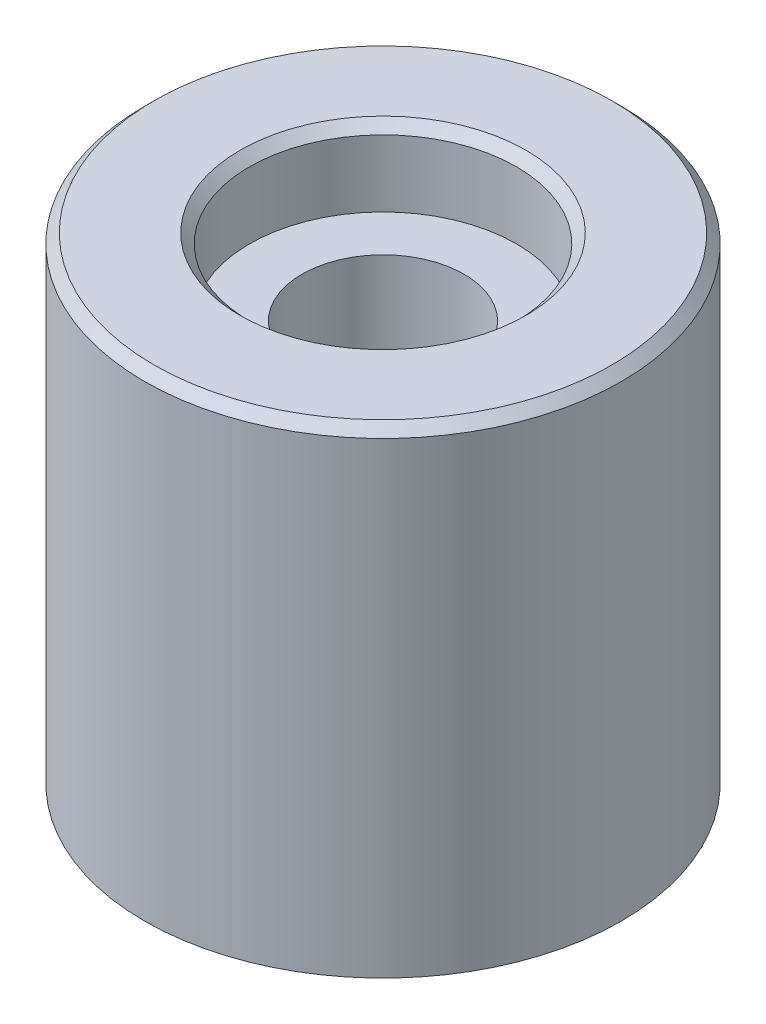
ISO-10303-21;
HEADER;
FILE_DESCRIPTION(('STEP AP214'),'2;1');
FILE_NAME('part.step','',(''),(''),'','','');
FILE_SCHEMA(('AUTOMOTIVE_DESIGN { 1 0 10303 214 1 1 1 1 }'));
ENDSEC;
DATA;
#1=APPLICATION_CONTEXT('core data for automotive mechanical design processes');
#2=APPLICATION_PROTOCOL_DEFINITION('international standard','automotive_design',2000,#1);
#3=PRODUCT_CONTEXT('',#1,'mechanical');
#4=PRODUCT('Part','Part','',(#3));
#5=PRODUCT_RELATED_PRODUCT_CATEGORY('part','',(#4));
#6=PRODUCT_DEFINITION_FORMATION('','',#4);
#7=PRODUCT_DEFINITION_CONTEXT('part definition',#1,'design');
#8=PRODUCT_DEFINITION('design','',#6,#7);
#9=PRODUCT_DEFINITION_SHAPE('','',#8);
#10=(LENGTH_UNIT() NAMED_UNIT(*) SI_UNIT(.MILLI.,.METRE.));
#11=(NAMED_UNIT(*) PLANE_ANGLE_UNIT() SI_UNIT($,.RADIAN.));
#12=(NAMED_UNIT(*) SI_UNIT($,.STERADIAN.) SOLID_ANGLE_UNIT());
#13=UNCERTAINTY_MEASURE_WITH_UNIT(LENGTH_MEASURE(1.E-05),#10,'distance_accuracy_value','');
#14=(GEOMETRIC_REPRESENTATION_CONTEXT(3) GLOBAL_UNCERTAINTY_ASSIGNED_CONTEXT((#13)) GLOBAL_UNIT_ASSIGNED_CONTEXT((#10,
#11,#12)) REPRESENTATION_CONTEXT('',''));
#15=CARTESIAN_POINT('',(0.,0.,0.));
#16=DIRECTION('',(0.,0.,1.));
#17=DIRECTION('',(1.,0.,0.));
#18=AXIS2_PLACEMENT_3D('',#15,#16,#17);
#19=CARTESIAN_POINT('',(0.,0.,0.));
#20=DIRECTION('',(0.,1.,0.));
#21=DIRECTION('',(0.,0.,1.));
#22=AXIS2_PLACEMENT_3D('',#19,#20,#21);
#23=PLANE('',#22);
#24=CARTESIAN_POINT('',(0.,0.,0.));
#25=DIRECTION('',(0.,1.,0.));
#26=DIRECTION('',(0.,0.,1.));
#27=AXIS2_PLACEMENT_3D('',#24,#25,#26);
#28=CIRCLE('',#27,6.99999999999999);
#29=CARTESIAN_POINT('',(0.,0.,7.));
#30=VERTEX_POINT('',#29);
#31=EDGE_CURVE('E73',#30,#30,#28,.F.);
#32=ORIENTED_EDGE('',*,*,#31,.T.);
#33=EDGE_LOOP('',(#32));
#34=FACE_BOUND('',#33,.T.);
#35=ADVANCED_FACE('F40',(#34),#23,.F.);
#36=CARTESIAN_POINT('',(0.,0.,0.));
#37=DIRECTION('',(0.,-1.,0.));
#38=DIRECTION('',(0.,0.,-1.));
#39=AXIS2_PLACEMENT_3D('',#36,#37,#38);
#40=CYLINDRICAL_SURFACE('',#39,7.49999999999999);
#41=CARTESIAN_POINT('',(0.,0.500000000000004,0.));
#42=DIRECTION('',(0.,1.,0.));
#43=DIRECTION('',(0.,0.,1.));
#44=AXIS2_PLACEMENT_3D('',#41,#42,#43);
#45=CIRCLE('',#44,7.49999999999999);
#46=CARTESIAN_POINT('',(0.,0.500000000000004,7.5));
#47=VERTEX_POINT('',#46);
#48=EDGE_CURVE('E76',#47,#47,#45,.T.);
#49=ORIENTED_EDGE('',*,*,#48,.T.);
#50=EDGE_LOOP('',(#49));
#51=FACE_BOUND('',#50,.T.);
#52=CARTESIAN_POINT('',(0.,2.,0.));
#53=DIRECTION('',(0.,-1.,0.));
#54=DIRECTION('',(0.,0.,-1.));
#55=AXIS2_PLACEMENT_3D('',#52,#53,#54);
#56=CIRCLE('',#55,7.49999999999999);
#57=CARTESIAN_POINT('',(0.,2.,-7.5));
#58=VERTEX_POINT('',#57);
#59=EDGE_CURVE('E70',#58,#58,#56,.T.);
#60=ORIENTED_EDGE('',*,*,#59,.T.);
#61=EDGE_LOOP('',(#60));
#62=FACE_BOUND('',#61,.T.);
#63=ADVANCED_FACE('F114',(#51,#62),#40,.T.);
#64=CARTESIAN_POINT('',(-7.49999999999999,2.,0.));
#65=DIRECTION('',(0.,1.,0.));
#66=DIRECTION('',(0.,0.,1.));
#67=AXIS2_PLACEMENT_3D('',#64,#65,#66);
#68=PLANE('',#67);
#69=ORIENTED_EDGE('',*,*,#59,.F.);
#70=EDGE_LOOP('',(#69));
#71=FACE_BOUND('',#70,.T.);
#72=CARTESIAN_POINT('',(0.,2.,0.));
#73=DIRECTION('',(0.,-1.,0.));
#74=DIRECTION('',(0.,0.,-1.));
#75=AXIS2_PLACEMENT_3D('',#72,#73,#74);
#76=CIRCLE('',#75,12.5);
#77=CARTESIAN_POINT('',(0.,2.,-12.5));
#78=VERTEX_POINT('',#77);
#79=EDGE_CURVE('E63',#78,#78,#76,.T.);
#80=ORIENTED_EDGE('',*,*,#79,.T.);
#81=EDGE_LOOP('',(#80));
#82=FACE_BOUND('',#81,.T.);
#83=ADVANCED_FACE('F109',(#71,#82),#68,.F.);
#84=CARTESIAN_POINT('',(0.,0.,0.));
#85=DIRECTION('',(0.,-1.,0.));
#86=DIRECTION('',(0.,0.,-1.));
#87=AXIS2_PLACEMENT_3D('',#84,#85,#86);
#88=CYLINDRICAL_SURFACE('',#87,12.5);
#89=CARTESIAN_POINT('',(0.,26.5,0.));
#90=DIRECTION('',(0.,-1.,0.));
#91=DIRECTION('',(0.,0.,-1.));
#92=AXIS2_PLACEMENT_3D('',#89,#90,#91);
#93=CIRCLE('',#92,12.5);
#94=CARTESIAN_POINT('',(0.,26.5,-12.5));
#95=VERTEX_POINT('',#94);
#96=EDGE_CURVE('E11',#95,#95,#93,.T.);
#97=ORIENTED_EDGE('',*,*,#96,.T.);
#98=EDGE_LOOP('',(#97));
#99=FACE_BOUND('',#98,.T.);
#100=ORIENTED_EDGE('',*,*,#79,.F.);
#101=EDGE_LOOP('',(#100));
#102=FACE_BOUND('',#101,.T.);
#103=ADVANCED_FACE('F99',(#99,#102),#88,.T.);
#104=CARTESIAN_POINT('',(-12.5,27.,0.));
#105=DIRECTION('',(0.,-1.,0.));
#106=DIRECTION('',(0.,0.,-1.));
#107=AXIS2_PLACEMENT_3D('',#104,#105,#106);
#108=PLANE('',#107);
#109=CARTESIAN_POINT('',(0.,27.,0.));
#110=DIRECTION('',(0.,-1.,0.));
#111=DIRECTION('',(0.,0.,-1.));
#112=AXIS2_PLACEMENT_3D('',#109,#110,#111);
#113=CIRCLE('',#112,7.5);
#114=CARTESIAN_POINT('',(0.,27.,-7.5));
#115=VERTEX_POINT('',#114);
#116=EDGE_CURVE('E82',#115,#115,#113,.T.);
#117=ORIENTED_EDGE('',*,*,#116,.T.);
#118=EDGE_LOOP('',(#117));
#119=FACE_BOUND('',#118,.T.);
#120=CARTESIAN_POINT('',(0.,27.,0.));
#121=DIRECTION('',(0.,-1.,0.));
#122=DIRECTION('',(0.,0.,-1.));
#123=AXIS2_PLACEMENT_3D('',#120,#121,#122);
#124=CIRCLE('',#123,12.);
#125=CARTESIAN_POINT('',(0.,27.,-12.));
#126=VERTEX_POINT('',#125);
#127=EDGE_CURVE('E79',#126,#126,#124,.F.);
#128=ORIENTED_EDGE('',*,*,#127,.T.);
#129=EDGE_LOOP('',(#128));
#130=FACE_BOUND('',#129,.T.);
#131=ADVANCED_FACE('F96',(#119,#130),#108,.F.);
#132=CARTESIAN_POINT('',(0.,0.,0.));
#133=DIRECTION('',(0.,-1.,0.));
#134=DIRECTION('',(0.,0.,-1.));
#135=AXIS2_PLACEMENT_3D('',#132,#133,#134);
#136=CYLINDRICAL_SURFACE('',#135,7.);
#137=CARTESIAN_POINT('',(0.,26.5,0.));
#138=DIRECTION('',(0.,-1.,0.));
#139=DIRECTION('',(0.,0.,-1.));
#140=AXIS2_PLACEMENT_3D('',#137,#138,#139);
#141=CIRCLE('',#140,7.);
#142=CARTESIAN_POINT('',(0.,26.5,-7.));
#143=VERTEX_POINT('',#142);
#144=EDGE_CURVE('E47',#143,#143,#141,.F.);
#145=ORIENTED_EDGE('',*,*,#144,.T.);
#146=EDGE_LOOP('',(#145));
#147=FACE_BOUND('',#146,.T.);
#148=CARTESIAN_POINT('',(0.,23.,0.));
#149=DIRECTION('',(0.,-1.,0.));
#150=DIRECTION('',(0.,0.,-1.));
#151=AXIS2_PLACEMENT_3D('',#148,#149,#150);
#152=CIRCLE('',#151,7.);
#153=CARTESIAN_POINT('',(0.,23.,-7.));
#154=VERTEX_POINT('',#153);
#155=EDGE_CURVE('E59',#154,#154,#152,.T.);
#156=ORIENTED_EDGE('',*,*,#155,.T.);
#157=EDGE_LOOP('',(#156));
#158=FACE_BOUND('',#157,.T.);
#159=ADVANCED_FACE('F87',(#147,#158),#136,.F.);
#160=CARTESIAN_POINT('',(-6.99999999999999,23.,0.));
#161=DIRECTION('',(0.,-1.,0.));
#162=DIRECTION('',(0.,0.,-1.));
#163=AXIS2_PLACEMENT_3D('',#160,#161,#162);
#164=PLANE('',#163);
#165=CARTESIAN_POINT('',(0.,23.,0.));
#166=DIRECTION('',(0.,1.,0.));
#167=DIRECTION('',(0.,0.,1.));
#168=AXIS2_PLACEMENT_3D('',#165,#166,#167);
#169=CIRCLE('',#168,4.24999999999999);
#170=CARTESIAN_POINT('',(0.,23.,4.24999999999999));
#171=VERTEX_POINT('',#170);
#172=EDGE_CURVE('E60',#171,#171,#169,.T.);
#173=ORIENTED_EDGE('',*,*,#172,.F.);
#174=EDGE_LOOP('',(#173));
#175=FACE_BOUND('',#174,.T.);
#176=ORIENTED_EDGE('',*,*,#155,.F.);
#177=EDGE_LOOP('',(#176));
#178=FACE_BOUND('',#177,.T.);
#179=ADVANCED_FACE('F130',(#175,#178),#164,.F.);
#180=CARTESIAN_POINT('',(0.,0.,0.));
#181=DIRECTION('',(0.,1.,0.));
#182=DIRECTION('',(0.,0.,1.));
#183=AXIS2_PLACEMENT_3D('',#180,#181,#182);
#184=CONICAL_SURFACE('',#183,6.99999999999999,0.785398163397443);
#185=ORIENTED_EDGE('',*,*,#48,.F.);
#186=EDGE_LOOP('',(#185));
#187=FACE_BOUND('',#186,.T.);
#188=ORIENTED_EDGE('',*,*,#31,.F.);
#189=EDGE_LOOP('',(#188));
#190=FACE_BOUND('',#189,.T.);
#191=ADVANCED_FACE('F93',(#187,#190),#184,.T.);
#192=CARTESIAN_POINT('',(0.,27.,0.));
#193=DIRECTION('',(0.,1.,0.));
#194=DIRECTION('',(0.,0.,1.));
#195=AXIS2_PLACEMENT_3D('',#192,#193,#194);
#196=CONICAL_SURFACE('',#195,7.5,0.785398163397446);
#197=ORIENTED_EDGE('',*,*,#144,.F.);
#198=EDGE_LOOP('',(#197));
#199=FACE_BOUND('',#198,.T.);
#200=ORIENTED_EDGE('',*,*,#116,.F.);
#201=EDGE_LOOP('',(#200));
#202=FACE_BOUND('',#201,.T.);
#203=ADVANCED_FACE('F90',(#199,#202),#196,.F.);
#204=CARTESIAN_POINT('',(0.,26.5,0.));
#205=DIRECTION('',(0.,-1.,0.));
#206=DIRECTION('',(0.,0.,-1.));
#207=AXIS2_PLACEMENT_3D('',#204,#205,#206);
#208=CONICAL_SURFACE('',#207,12.5,0.785398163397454);
#209=ORIENTED_EDGE('',*,*,#127,.F.);
#210=EDGE_LOOP('',(#209));
#211=FACE_BOUND('',#210,.T.);
#212=ORIENTED_EDGE('',*,*,#96,.F.);
#213=EDGE_LOOP('',(#212));
#214=FACE_BOUND('',#213,.T.);
#215=ADVANCED_FACE('F42',(#211,#214),#208,.T.);
#216=CARTESIAN_POINT('',(0.,4.99999999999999,0.));
#217=DIRECTION('',(0.,1.,0.));
#218=DIRECTION('',(0.,0.,1.));
#219=AXIS2_PLACEMENT_3D('',#216,#217,#218);
#220=CONICAL_SURFACE('',#219,4.24999999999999,1.02974425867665);
#221=CARTESIAN_POINT('',(0.,2.44634236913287,0.));
#222=VERTEX_POINT('',#221);
#223=VERTEX_LOOP('',#222);
#224=FACE_BOUND('',#223,.T.);
#225=CARTESIAN_POINT('',(0.,4.99999999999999,0.));
#226=DIRECTION('',(0.,1.,0.));
#227=DIRECTION('',(0.,0.,1.));
#228=AXIS2_PLACEMENT_3D('',#225,#226,#227);
#229=CIRCLE('',#228,4.24999999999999);
#230=CARTESIAN_POINT('',(0.,4.99999999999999,4.24999999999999));
#231=VERTEX_POINT('',#230);
#232=EDGE_CURVE('E57',#231,#231,#229,.T.);
#233=ORIENTED_EDGE('',*,*,#232,.T.);
#234=EDGE_LOOP('',(#233));
#235=FACE_BOUND('',#234,.T.);
#236=ADVANCED_FACE('F50',(#224,#235),#220,.F.);
#237=CARTESIAN_POINT('',(0.,23.,0.));
#238=DIRECTION('',(0.,1.,0.));
#239=DIRECTION('',(0.,0.,1.));
#240=AXIS2_PLACEMENT_3D('',#237,#238,#239);
#241=CYLINDRICAL_SURFACE('',#240,4.24999999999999);
#242=ORIENTED_EDGE('',*,*,#232,.F.);
#243=EDGE_LOOP('',(#242));
#244=FACE_BOUND('',#243,.T.);
#245=ORIENTED_EDGE('',*,*,#172,.T.);
#246=EDGE_LOOP('',(#245));
#247=FACE_BOUND('',#246,.T.);
#248=ADVANCED_FACE('F53',(#244,#247),#241,.F.);
#249=CLOSED_SHELL('',(#35,#63,#83,#103,#131,#159,#179,#191,#203,#215,#236,#248));
#250=MANIFOLD_SOLID_BREP('B2',#249);
#251=ADVANCED_BREP_SHAPE_REPRESENTATION('',(#18,#250),#14);
#252=SHAPE_DEFINITION_REPRESENTATION(#9,#251);
ENDSEC;
END-ISO-10303-21;
